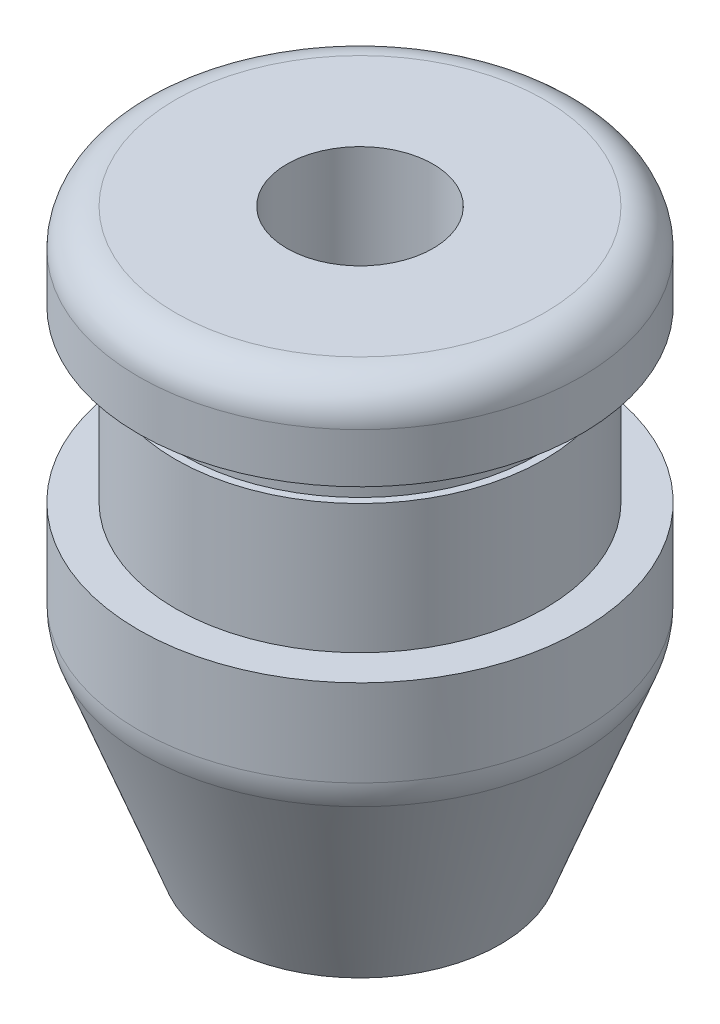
ISO-10303-21;
HEADER;
FILE_DESCRIPTION(('STEP AP214'),'2;1');
FILE_NAME('part.step','',(''),(''),'','','');
FILE_SCHEMA(('AUTOMOTIVE_DESIGN { 1 0 10303 214 1 1 1 1 }'));
ENDSEC;
DATA;
#1=APPLICATION_CONTEXT('core data for automotive mechanical design processes');
#2=APPLICATION_PROTOCOL_DEFINITION('international standard','automotive_design',2000,#1);
#3=PRODUCT_CONTEXT('',#1,'mechanical');
#4=PRODUCT('Part','Part','',(#3));
#5=PRODUCT_RELATED_PRODUCT_CATEGORY('part','',(#4));
#6=PRODUCT_DEFINITION_FORMATION('','',#4);
#7=PRODUCT_DEFINITION_CONTEXT('part definition',#1,'design');
#8=PRODUCT_DEFINITION('design','',#6,#7);
#9=PRODUCT_DEFINITION_SHAPE('','',#8);
#10=(LENGTH_UNIT() NAMED_UNIT(*) SI_UNIT(.MILLI.,.METRE.));
#11=(NAMED_UNIT(*) PLANE_ANGLE_UNIT() SI_UNIT($,.RADIAN.));
#12=(NAMED_UNIT(*) SI_UNIT($,.STERADIAN.) SOLID_ANGLE_UNIT());
#13=UNCERTAINTY_MEASURE_WITH_UNIT(LENGTH_MEASURE(1.E-05),#10,'distance_accuracy_value','');
#14=(GEOMETRIC_REPRESENTATION_CONTEXT(3) GLOBAL_UNCERTAINTY_ASSIGNED_CONTEXT((#13)) GLOBAL_UNIT_ASSIGNED_CONTEXT((#10,
#11,#12)) REPRESENTATION_CONTEXT('',''));
#15=CARTESIAN_POINT('',(0.,0.,0.));
#16=DIRECTION('',(0.,0.,1.));
#17=DIRECTION('',(1.,0.,0.));
#18=AXIS2_PLACEMENT_3D('',#15,#16,#17);
#19=CARTESIAN_POINT('',(-6.223,15.2146,0.));
#20=DIRECTION('',(0.,-1.,0.));
#21=DIRECTION('',(0.,0.,-1.));
#22=AXIS2_PLACEMENT_3D('',#19,#20,#21);
#23=PLANE('',#22);
#24=CARTESIAN_POINT('',(0.,15.2146,0.));
#25=DIRECTION('',(0.,1.,0.));
#26=DIRECTION('',(0.,0.,1.));
#27=AXIS2_PLACEMENT_3D('',#24,#25,#26);
#28=CIRCLE('',#27,6.096);
#29=CARTESIAN_POINT('',(0.,15.2146,6.096));
#30=VERTEX_POINT('',#29);
#31=EDGE_CURVE('E48',#30,#30,#28,.T.);
#32=ORIENTED_EDGE('',*,*,#31,.F.);
#33=EDGE_LOOP('',(#32));
#34=FACE_BOUND('',#33,.T.);
#35=CARTESIAN_POINT('',(0.,15.2146,0.));
#36=DIRECTION('',(0.,1.,0.));
#37=DIRECTION('',(0.,0.,1.));
#38=AXIS2_PLACEMENT_3D('',#35,#36,#37);
#39=CIRCLE('',#38,6.35);
#40=CARTESIAN_POINT('',(0.,15.2146,6.35));
#41=VERTEX_POINT('',#40);
#42=EDGE_CURVE('E18',#41,#41,#39,.F.);
#43=ORIENTED_EDGE('',*,*,#42,.F.);
#44=EDGE_LOOP('',(#43));
#45=FACE_BOUND('',#44,.T.);
#46=ADVANCED_FACE('F15',(#34,#45),#23,.F.);
#47=CARTESIAN_POINT('',(0.,12.9921,0.));
#48=DIRECTION('',(0.,1.,0.));
#49=DIRECTION('',(0.,0.,1.));
#50=AXIS2_PLACEMENT_3D('',#47,#48,#49);
#51=CYLINDRICAL_SURFACE('',#50,6.35);
#52=ORIENTED_EDGE('',*,*,#42,.T.);
#53=EDGE_LOOP('',(#52));
#54=FACE_BOUND('',#53,.T.);
#55=CARTESIAN_POINT('',(0.,10.7696,0.));
#56=DIRECTION('',(0.,1.,0.));
#57=DIRECTION('',(0.,0.,1.));
#58=AXIS2_PLACEMENT_3D('',#55,#56,#57);
#59=CIRCLE('',#58,6.35);
#60=CARTESIAN_POINT('',(0.,10.7696,6.35));
#61=VERTEX_POINT('',#60);
#62=EDGE_CURVE('E46',#61,#61,#59,.T.);
#63=ORIENTED_EDGE('',*,*,#62,.T.);
#64=EDGE_LOOP('',(#63));
#65=FACE_BOUND('',#64,.T.);
#66=ADVANCED_FACE('F55',(#54,#65),#51,.T.);
#67=CARTESIAN_POINT('',(0.,15.9131,0.));
#68=DIRECTION('',(0.,1.,0.));
#69=DIRECTION('',(0.,0.,1.));
#70=AXIS2_PLACEMENT_3D('',#67,#68,#69);
#71=CYLINDRICAL_SURFACE('',#70,6.096);
#72=CARTESIAN_POINT('',(0.,16.6116,0.));
#73=DIRECTION('',(0.,1.,0.));
#74=DIRECTION('',(0.,0.,1.));
#75=AXIS2_PLACEMENT_3D('',#72,#73,#74);
#76=CIRCLE('',#75,6.096);
#77=CARTESIAN_POINT('',(0.,16.6116,6.096));
#78=VERTEX_POINT('',#77);
#79=EDGE_CURVE('E43',#78,#78,#76,.F.);
#80=ORIENTED_EDGE('',*,*,#79,.T.);
#81=EDGE_LOOP('',(#80));
#82=FACE_BOUND('',#81,.T.);
#83=ORIENTED_EDGE('',*,*,#31,.T.);
#84=EDGE_LOOP('',(#83));
#85=FACE_BOUND('',#84,.T.);
#86=ADVANCED_FACE('F64',(#82,#85),#71,.T.);
#87=CARTESIAN_POINT('',(-6.985,10.7696,0.));
#88=DIRECTION('',(0.,-1.,0.));
#89=DIRECTION('',(0.,0.,-1.));
#90=AXIS2_PLACEMENT_3D('',#87,#88,#89);
#91=PLANE('',#90);
#92=ORIENTED_EDGE('',*,*,#62,.F.);
#93=EDGE_LOOP('',(#92));
#94=FACE_BOUND('',#93,.T.);
#95=CARTESIAN_POINT('',(0.,10.7696,0.));
#96=DIRECTION('',(0.,1.,0.));
#97=DIRECTION('',(0.,0.,1.));
#98=AXIS2_PLACEMENT_3D('',#95,#96,#97);
#99=CIRCLE('',#98,7.62);
#100=CARTESIAN_POINT('',(0.,10.7696,7.62));
#101=VERTEX_POINT('',#100);
#102=EDGE_CURVE('E40',#101,#101,#99,.F.);
#103=ORIENTED_EDGE('',*,*,#102,.F.);
#104=EDGE_LOOP('',(#103));
#105=FACE_BOUND('',#104,.T.);
#106=ADVANCED_FACE('F139',(#94,#105),#91,.F.);
#107=CARTESIAN_POINT('',(-6.858,16.6116,0.));
#108=DIRECTION('',(0.,1.,0.));
#109=DIRECTION('',(0.,0.,1.));
#110=AXIS2_PLACEMENT_3D('',#107,#108,#109);
#111=PLANE('',#110);
#112=CARTESIAN_POINT('',(0.,16.6116,0.));
#113=DIRECTION('',(0.,1.,0.));
#114=DIRECTION('',(0.,0.,1.));
#115=AXIS2_PLACEMENT_3D('',#112,#113,#114);
#116=CIRCLE('',#115,7.62);
#117=CARTESIAN_POINT('',(0.,16.6116,7.62));
#118=VERTEX_POINT('',#117);
#119=EDGE_CURVE('E36',#118,#118,#116,.T.);
#120=ORIENTED_EDGE('',*,*,#119,.F.);
#121=EDGE_LOOP('',(#120));
#122=FACE_BOUND('',#121,.T.);
#123=ORIENTED_EDGE('',*,*,#79,.F.);
#124=EDGE_LOOP('',(#123));
#125=FACE_BOUND('',#124,.T.);
#126=ADVANCED_FACE('F136',(#122,#125),#111,.F.);
#127=CARTESIAN_POINT('',(0.,0.,0.));
#128=DIRECTION('',(0.,1.,0.));
#129=DIRECTION('',(0.,0.,1.));
#130=AXIS2_PLACEMENT_3D('',#127,#128,#129);
#131=CYLINDRICAL_SURFACE('',#130,7.62);
#132=CARTESIAN_POINT('',(0.,7.7849873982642,0.));
#133=DIRECTION('',(0.,-1.,0.));
#134=DIRECTION('',(1.,0.,0.));
#135=AXIS2_PLACEMENT_3D('',#132,#133,#134);
#136=CIRCLE('',#135,7.62);
#137=CARTESIAN_POINT('',(7.62,7.7849873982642,0.));
#138=VERTEX_POINT('',#137);
#139=EDGE_CURVE('E39',#138,#138,#136,.T.);
#140=ORIENTED_EDGE('',*,*,#139,.F.);
#141=EDGE_LOOP('',(#140));
#142=FACE_BOUND('',#141,.T.);
#143=ORIENTED_EDGE('',*,*,#102,.T.);
#144=EDGE_LOOP('',(#143));
#145=FACE_BOUND('',#144,.T.);
#146=ADVANCED_FACE('F133',(#142,#145),#131,.T.);
#147=CARTESIAN_POINT('',(0.,0.,0.));
#148=DIRECTION('',(0.,1.,0.));
#149=DIRECTION('',(0.,0.,1.));
#150=AXIS2_PLACEMENT_3D('',#147,#148,#149);
#151=CYLINDRICAL_SURFACE('',#150,7.62);
#152=CARTESIAN_POINT('',(0.,18.3134,0.));
#153=DIRECTION('',(0.,-1.,0.));
#154=DIRECTION('',(1.,0.,0.));
#155=AXIS2_PLACEMENT_3D('',#152,#153,#154);
#156=CIRCLE('',#155,7.62);
#157=CARTESIAN_POINT('',(7.62,18.3134,0.));
#158=VERTEX_POINT('',#157);
#159=EDGE_CURVE('E98',#158,#158,#156,.F.);
#160=ORIENTED_EDGE('',*,*,#159,.F.);
#161=EDGE_LOOP('',(#160));
#162=FACE_BOUND('',#161,.T.);
#163=ORIENTED_EDGE('',*,*,#119,.T.);
#164=EDGE_LOOP('',(#163));
#165=FACE_BOUND('',#164,.T.);
#166=ADVANCED_FACE('F130',(#162,#165),#151,.T.);
#167=CARTESIAN_POINT('',(0.,7.7849873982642,0.));
#168=DIRECTION('',(0.,-1.,0.));
#169=DIRECTION('',(1.,0.,0.));
#170=AXIS2_PLACEMENT_3D('',#167,#168,#169);
#171=TOROIDAL_SURFACE('',#170,5.334,2.286);
#172=CARTESIAN_POINT('',(0.,6.9742478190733,0.));
#173=DIRECTION('',(0.,1.,0.));
#174=DIRECTION('',(-1.,0.,0.));
#175=AXIS2_PLACEMENT_3D('',#172,#173,#174);
#176=CIRCLE('',#175,7.47140434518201);
#177=CARTESIAN_POINT('',(-7.47140434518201,6.9742478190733,0.));
#178=VERTEX_POINT('',#177);
#179=EDGE_CURVE('E90',#178,#178,#176,.F.);
#180=ORIENTED_EDGE('',*,*,#179,.F.);
#181=EDGE_LOOP('',(#180));
#182=FACE_BOUND('',#181,.T.);
#183=ORIENTED_EDGE('',*,*,#139,.T.);
#184=EDGE_LOOP('',(#183));
#185=FACE_BOUND('',#184,.T.);
#186=ADVANCED_FACE('F108',(#182,#185),#171,.T.);
#187=CARTESIAN_POINT('',(0.,18.3134,0.));
#188=DIRECTION('',(0.,-1.,0.));
#189=DIRECTION('',(1.,0.,0.));
#190=AXIS2_PLACEMENT_3D('',#187,#188,#189);
#191=TOROIDAL_SURFACE('',#190,6.35,1.27);
#192=ORIENTED_EDGE('',*,*,#159,.T.);
#193=EDGE_LOOP('',(#192));
#194=FACE_BOUND('',#193,.T.);
#195=CARTESIAN_POINT('',(0.,19.5834,0.));
#196=DIRECTION('',(0.,-1.,0.));
#197=DIRECTION('',(1.,0.,0.));
#198=AXIS2_PLACEMENT_3D('',#195,#196,#197);
#199=CIRCLE('',#198,6.35);
#200=CARTESIAN_POINT('',(6.35,19.5834,0.));
#201=VERTEX_POINT('',#200);
#202=EDGE_CURVE('E35',#201,#201,#199,.F.);
#203=ORIENTED_EDGE('',*,*,#202,.F.);
#204=EDGE_LOOP('',(#203));
#205=FACE_BOUND('',#204,.T.);
#206=ADVANCED_FACE('F104',(#194,#205),#191,.T.);
#207=CARTESIAN_POINT('',(0.,6.97424781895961,0.));
#208=DIRECTION('',(0.,1.,0.));
#209=DIRECTION('',(0.,0.,1.));
#210=AXIS2_PLACEMENT_3D('',#207,#208,#209);
#211=CONICAL_SURFACE('',#210,7.47140434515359,0.36254423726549);
#212=ORIENTED_EDGE('',*,*,#179,.T.);
#213=EDGE_LOOP('',(#212));
#214=FACE_BOUND('',#213,.T.);
#215=CARTESIAN_POINT('',(0.,0.,0.));
#216=DIRECTION('',(0.,1.,0.));
#217=DIRECTION('',(0.,0.,1.));
#218=AXIS2_PLACEMENT_3D('',#215,#216,#217);
#219=CIRCLE('',#218,4.82600000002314);
#220=CARTESIAN_POINT('',(0.,0.,4.82600000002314));
#221=VERTEX_POINT('',#220);
#222=EDGE_CURVE('E27',#221,#221,#219,.T.);
#223=ORIENTED_EDGE('',*,*,#222,.T.);
#224=EDGE_LOOP('',(#223));
#225=FACE_BOUND('',#224,.T.);
#226=ADVANCED_FACE('F81',(#214,#225),#211,.T.);
#227=CARTESIAN_POINT('',(0.,19.5834,0.));
#228=DIRECTION('',(0.,1.,0.));
#229=DIRECTION('',(0.,0.,1.));
#230=AXIS2_PLACEMENT_3D('',#227,#228,#229);
#231=PLANE('',#230);
#232=ORIENTED_EDGE('',*,*,#202,.T.);
#233=EDGE_LOOP('',(#232));
#234=FACE_BOUND('',#233,.T.);
#235=CARTESIAN_POINT('',(0.,19.5834,0.));
#236=DIRECTION('',(0.,1.,0.));
#237=DIRECTION('',(0.,0.,1.));
#238=AXIS2_PLACEMENT_3D('',#235,#236,#237);
#239=CIRCLE('',#238,2.5146);
#240=CARTESIAN_POINT('',(0.,19.5834,2.5146));
#241=VERTEX_POINT('',#240);
#242=EDGE_CURVE('E22',#241,#241,#239,.F.);
#243=ORIENTED_EDGE('',*,*,#242,.T.);
#244=EDGE_LOOP('',(#243));
#245=FACE_BOUND('',#244,.T.);
#246=ADVANCED_FACE('F73',(#234,#245),#231,.T.);
#247=CARTESIAN_POINT('',(0.,0.,0.));
#248=DIRECTION('',(0.,1.,0.));
#249=DIRECTION('',(0.,0.,1.));
#250=AXIS2_PLACEMENT_3D('',#247,#248,#249);
#251=PLANE('',#250);
#252=ORIENTED_EDGE('',*,*,#222,.F.);
#253=EDGE_LOOP('',(#252));
#254=FACE_BOUND('',#253,.T.);
#255=CARTESIAN_POINT('',(0.,0.,0.));
#256=DIRECTION('',(0.,1.,0.));
#257=DIRECTION('',(0.,0.,1.));
#258=AXIS2_PLACEMENT_3D('',#255,#256,#257);
#259=CIRCLE('',#258,2.5146);
#260=CARTESIAN_POINT('',(0.,0.,2.5146));
#261=VERTEX_POINT('',#260);
#262=EDGE_CURVE('E10',#261,#261,#259,.T.);
#263=ORIENTED_EDGE('',*,*,#262,.T.);
#264=EDGE_LOOP('',(#263));
#265=FACE_BOUND('',#264,.T.);
#266=ADVANCED_FACE('F67',(#254,#265),#251,.F.);
#267=CARTESIAN_POINT('',(0.,0.,0.));
#268=DIRECTION('',(0.,1.,0.));
#269=DIRECTION('',(0.,0.,1.));
#270=AXIS2_PLACEMENT_3D('',#267,#268,#269);
#271=CYLINDRICAL_SURFACE('',#270,2.5146);
#272=ORIENTED_EDGE('',*,*,#262,.F.);
#273=EDGE_LOOP('',(#272));
#274=FACE_BOUND('',#273,.T.);
#275=ORIENTED_EDGE('',*,*,#242,.F.);
#276=EDGE_LOOP('',(#275));
#277=FACE_BOUND('',#276,.T.);
#278=ADVANCED_FACE('F65',(#274,#277),#271,.F.);
#279=CLOSED_SHELL('',(#46,#66,#86,#106,#126,#146,#166,#186,#206,#226,#246,#266,#278));
#280=MANIFOLD_SOLID_BREP('B1',#279);
#281=ADVANCED_BREP_SHAPE_REPRESENTATION('',(#18,#280),#14);
#282=SHAPE_DEFINITION_REPRESENTATION(#9,#281);
ENDSEC;
END-ISO-10303-21;
